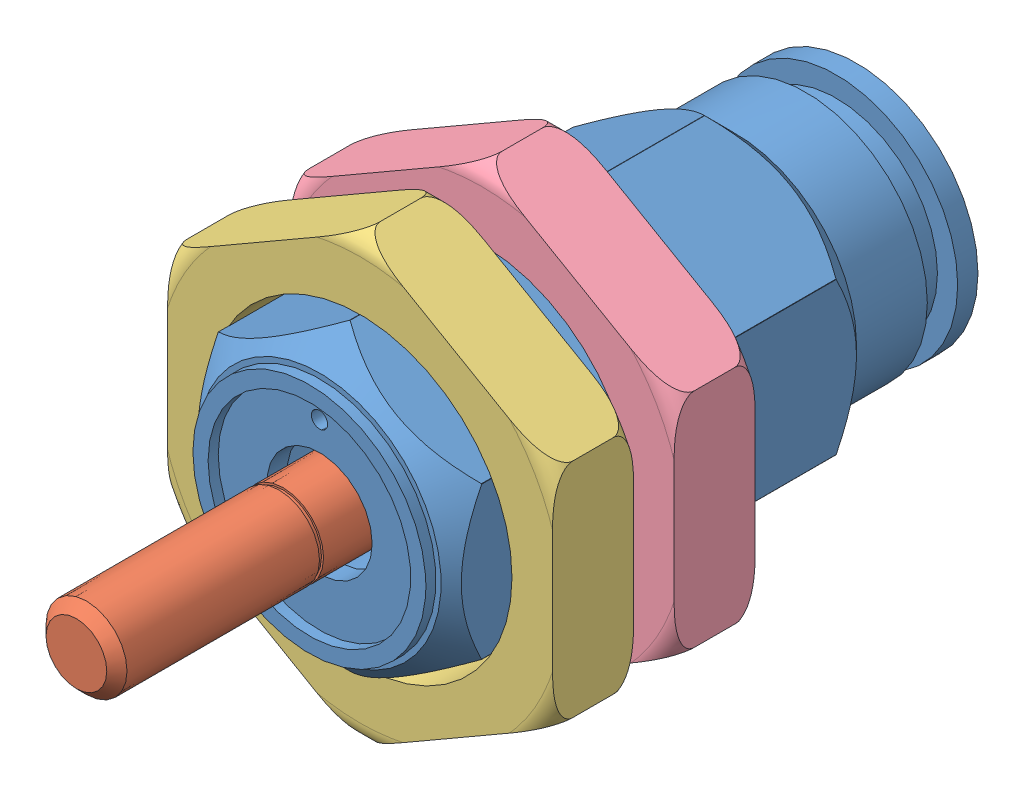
SolidWorks assembly 04531415.SLDASM, configuration Default (file format 8000). Lengths in mm.
Overall size (19.02 21.95 38.5).
4 component instances, 4 part files, 0 mates.
Components (placement in the parent):
- 04531415_01-1: 04531415_01.SLDPRT [Default] at origin size (13 15.01 27)
- 04531415_02-1: 04531415_02.SLDPRT [Default] at origin size (10 10 24)
- 04531415_03-1: 04531415_03.SLDPRT [Default] at origin size (19.02 21.95 4.02)
- 04531415_04-1: 04531415_04.SLDPRT [Default] at origin size (19.02 21.95 4.02)
